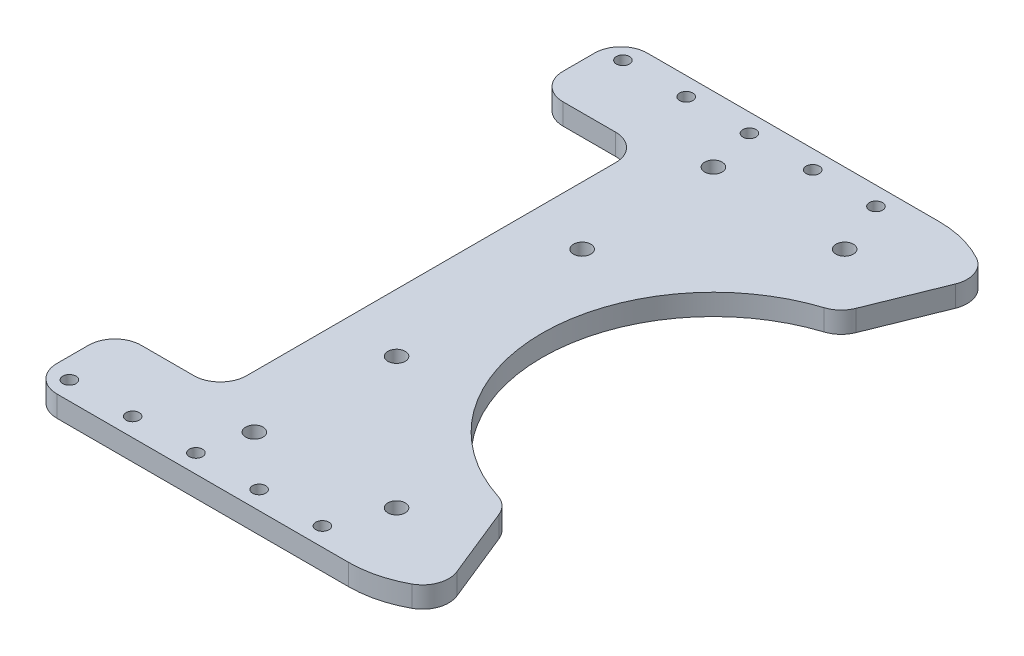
ISO-10303-21;
HEADER;
FILE_DESCRIPTION(('STEP AP214'),'2;1');
FILE_NAME('part.step','',(''),(''),'','','');
FILE_SCHEMA(('AUTOMOTIVE_DESIGN { 1 0 10303 214 1 1 1 1 }'));
ENDSEC;
DATA;
#1=APPLICATION_CONTEXT('core data for automotive mechanical design processes');
#2=APPLICATION_PROTOCOL_DEFINITION('international standard','automotive_design',2000,#1);
#3=PRODUCT_CONTEXT('',#1,'mechanical');
#4=PRODUCT('Part','Part','',(#3));
#5=PRODUCT_RELATED_PRODUCT_CATEGORY('part','',(#4));
#6=PRODUCT_DEFINITION_FORMATION('','',#4);
#7=PRODUCT_DEFINITION_CONTEXT('part definition',#1,'design');
#8=PRODUCT_DEFINITION('design','',#6,#7);
#9=PRODUCT_DEFINITION_SHAPE('','',#8);
#10=(LENGTH_UNIT() NAMED_UNIT(*) SI_UNIT(.MILLI.,.METRE.));
#11=(NAMED_UNIT(*) PLANE_ANGLE_UNIT() SI_UNIT($,.RADIAN.));
#12=(NAMED_UNIT(*) SI_UNIT($,.STERADIAN.) SOLID_ANGLE_UNIT());
#13=UNCERTAINTY_MEASURE_WITH_UNIT(LENGTH_MEASURE(1.E-05),#10,'distance_accuracy_value','');
#14=(GEOMETRIC_REPRESENTATION_CONTEXT(3) GLOBAL_UNCERTAINTY_ASSIGNED_CONTEXT((#13)) GLOBAL_UNIT_ASSIGNED_CONTEXT((#10,
#11,#12)) REPRESENTATION_CONTEXT('',''));
#15=CARTESIAN_POINT('',(0.,0.,0.));
#16=DIRECTION('',(0.,0.,1.));
#17=DIRECTION('',(1.,0.,0.));
#18=AXIS2_PLACEMENT_3D('',#15,#16,#17);
#19=CARTESIAN_POINT('',(83.4007857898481,3.,-81.060672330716));
#20=DIRECTION('',(1.,0.,0.));
#21=DIRECTION('',(0.,0.,-1.));
#22=AXIS2_PLACEMENT_3D('',#19,#20,#21);
#23=PLANE('',#22);
#24=DIRECTION('',(0.,0.,-1.));
#25=VECTOR('',#24,1.);
#26=CARTESIAN_POINT('',(83.4007857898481,3.,-81.060672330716));
#27=LINE('',#26,#25);
#28=CARTESIAN_POINT('',(83.4007857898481,3.,51.));
#29=VERTEX_POINT('',#28);
#30=CARTESIAN_POINT('',(83.4007857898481,3.,45.));
#31=VERTEX_POINT('',#30);
#32=EDGE_CURVE('E235',#29,#31,#27,.T.);
#33=ORIENTED_EDGE('',*,*,#32,.T.);
#34=DIRECTION('',(0.,1.,0.));
#35=VECTOR('',#34,1.);
#36=CARTESIAN_POINT('',(83.4007857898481,3.,45.));
#37=LINE('',#36,#35);
#38=CARTESIAN_POINT('',(83.4007857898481,-1.,45.));
#39=VERTEX_POINT('',#38);
#40=EDGE_CURVE('E486',#31,#39,#37,.F.);
#41=ORIENTED_EDGE('',*,*,#40,.T.);
#42=DIRECTION('',(0.,0.,1.));
#43=VECTOR('',#42,1.);
#44=CARTESIAN_POINT('',(83.4007857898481,-1.,0.));
#45=LINE('',#44,#43);
#46=CARTESIAN_POINT('',(83.4007857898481,-1.,51.));
#47=VERTEX_POINT('',#46);
#48=EDGE_CURVE('E394',#47,#39,#45,.F.);
#49=ORIENTED_EDGE('',*,*,#48,.F.);
#50=DIRECTION('',(0.,1.,0.));
#51=VECTOR('',#50,1.);
#52=CARTESIAN_POINT('',(83.4007857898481,3.,51.));
#53=LINE('',#52,#51);
#54=EDGE_CURVE('E457',#47,#29,#53,.T.);
#55=ORIENTED_EDGE('',*,*,#54,.T.);
#56=EDGE_LOOP('',(#33,#41,#49,#55));
#57=FACE_BOUND('',#56,.T.);
#58=ADVANCED_FACE('F49',(#57),#23,.F.);
#59=CARTESIAN_POINT('',(0.,3.,0.));
#60=DIRECTION('',(0.,1.,0.));
#61=DIRECTION('',(0.,0.,1.));
#62=AXIS2_PLACEMENT_3D('',#59,#60,#61);
#63=PLANE('',#62);
#64=CARTESIAN_POINT('',(99.2778298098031,3.,52.4999999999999));
#65=DIRECTION('',(0.,-1.,0.));
#66=DIRECTION('',(0.,0.,-1.));
#67=AXIS2_PLACEMENT_3D('',#64,#65,#66);
#68=CIRCLE('',#67,1.25);
#69=CARTESIAN_POINT('',(99.2778298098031,3.,51.2499999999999));
#70=VERTEX_POINT('',#69);
#71=EDGE_CURVE('E424',#70,#70,#68,.T.);
#72=ORIENTED_EDGE('',*,*,#71,.T.);
#73=EDGE_LOOP('',(#72));
#74=FACE_BOUND('',#73,.T.);
#75=CARTESIAN_POINT('',(111.277829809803,3.,52.4999999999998));
#76=DIRECTION('',(0.,-1.,0.));
#77=DIRECTION('',(0.,0.,-1.));
#78=AXIS2_PLACEMENT_3D('',#75,#76,#77);
#79=CIRCLE('',#78,1.25);
#80=CARTESIAN_POINT('',(111.277829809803,3.,51.2499999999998));
#81=VERTEX_POINT('',#80);
#82=EDGE_CURVE('E549',#81,#81,#79,.T.);
#83=ORIENTED_EDGE('',*,*,#82,.T.);
#84=EDGE_LOOP('',(#83));
#85=FACE_BOUND('',#84,.T.);
#86=CARTESIAN_POINT('',(135.277829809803,3.,-52.5));
#87=DIRECTION('',(0.,1.,0.));
#88=DIRECTION('',(0.,0.,1.));
#89=AXIS2_PLACEMENT_3D('',#86,#87,#88);
#90=CIRCLE('',#89,1.25000000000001);
#91=CARTESIAN_POINT('',(135.277829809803,3.,-51.25));
#92=VERTEX_POINT('',#91);
#93=EDGE_CURVE('E553',#92,#92,#90,.T.);
#94=ORIENTED_EDGE('',*,*,#93,.F.);
#95=EDGE_LOOP('',(#94));
#96=FACE_BOUND('',#95,.T.);
#97=CARTESIAN_POINT('',(123.277829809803,3.,-52.4999999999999));
#98=DIRECTION('',(0.,1.,0.));
#99=DIRECTION('',(0.,0.,1.));
#100=AXIS2_PLACEMENT_3D('',#97,#98,#99);
#101=CIRCLE('',#100,1.25);
#102=CARTESIAN_POINT('',(123.277829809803,3.,-51.2499999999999));
#103=VERTEX_POINT('',#102);
#104=EDGE_CURVE('E557',#103,#103,#101,.T.);
#105=ORIENTED_EDGE('',*,*,#104,.F.);
#106=EDGE_LOOP('',(#105));
#107=FACE_BOUND('',#106,.T.);
#108=CARTESIAN_POINT('',(113.400785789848,3.,-43.5370440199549));
#109=DIRECTION('',(0.,1.,0.));
#110=DIRECTION('',(0.,0.,1.));
#111=AXIS2_PLACEMENT_3D('',#108,#109,#110);
#112=CIRCLE('',#111,1.65);
#113=CARTESIAN_POINT('',(113.400785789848,3.,-41.8870440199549));
#114=VERTEX_POINT('',#113);
#115=EDGE_CURVE('E561',#114,#114,#112,.T.);
#116=ORIENTED_EDGE('',*,*,#115,.F.);
#117=EDGE_LOOP('',(#116));
#118=FACE_BOUND('',#117,.T.);
#119=CARTESIAN_POINT('',(114.437947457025,3.,17.6));
#120=DIRECTION('',(0.,1.,0.));
#121=DIRECTION('',(0.,0.,1.));
#122=AXIS2_PLACEMENT_3D('',#119,#120,#121);
#123=CIRCLE('',#122,1.65);
#124=CARTESIAN_POINT('',(114.437947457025,3.,19.25));
#125=VERTEX_POINT('',#124);
#126=EDGE_CURVE('E565',#125,#125,#123,.T.);
#127=ORIENTED_EDGE('',*,*,#126,.F.);
#128=EDGE_LOOP('',(#127));
#129=FACE_BOUND('',#128,.T.);
#130=CARTESIAN_POINT('',(114.44079544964,3.,-17.6068756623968));
#131=DIRECTION('',(0.,1.,0.));
#132=DIRECTION('',(0.,0.,1.));
#133=AXIS2_PLACEMENT_3D('',#130,#131,#132);
#134=CIRCLE('',#133,1.65);
#135=CARTESIAN_POINT('',(114.44079544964,3.,-15.9568756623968));
#136=VERTEX_POINT('',#135);
#137=EDGE_CURVE('E569',#136,#136,#134,.T.);
#138=ORIENTED_EDGE('',*,*,#137,.F.);
#139=EDGE_LOOP('',(#138));
#140=FACE_BOUND('',#139,.T.);
#141=CARTESIAN_POINT('',(139.337829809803,3.,-42.4998823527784));
#142=DIRECTION('',(0.,1.,0.));
#143=DIRECTION('',(0.,0.,1.));
#144=AXIS2_PLACEMENT_3D('',#141,#142,#143);
#145=CIRCLE('',#144,1.65000000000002);
#146=CARTESIAN_POINT('',(139.337829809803,3.,-40.8498823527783));
#147=VERTEX_POINT('',#146);
#148=EDGE_CURVE('E573',#147,#147,#145,.T.);
#149=ORIENTED_EDGE('',*,*,#148,.F.);
#150=EDGE_LOOP('',(#149));
#151=FACE_BOUND('',#150,.T.);
#152=CARTESIAN_POINT('',(139.330954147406,3.,42.4970343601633));
#153=DIRECTION('',(0.,1.,0.));
#154=DIRECTION('',(0.,0.,1.));
#155=AXIS2_PLACEMENT_3D('',#152,#153,#154);
#156=CIRCLE('',#155,1.65000000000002);
#157=CARTESIAN_POINT('',(139.330954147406,3.,44.1470343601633));
#158=VERTEX_POINT('',#157);
#159=EDGE_CURVE('E577',#158,#158,#156,.T.);
#160=ORIENTED_EDGE('',*,*,#159,.F.);
#161=EDGE_LOOP('',(#160));
#162=FACE_BOUND('',#161,.T.);
#163=CARTESIAN_POINT('',(113.400785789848,3.,43.5370440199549));
#164=DIRECTION('',(0.,1.,0.));
#165=DIRECTION('',(0.,0.,1.));
#166=AXIS2_PLACEMENT_3D('',#163,#164,#165);
#167=CIRCLE('',#166,1.65);
#168=CARTESIAN_POINT('',(113.400785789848,3.,45.1870440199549));
#169=VERTEX_POINT('',#168);
#170=EDGE_CURVE('E225',#169,#169,#167,.F.);
#171=ORIENTED_EDGE('',*,*,#170,.T.);
#172=EDGE_LOOP('',(#171));
#173=FACE_BOUND('',#172,.T.);
#174=CARTESIAN_POINT('',(111.277829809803,3.,-52.4999999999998));
#175=DIRECTION('',(0.,1.,0.));
#176=DIRECTION('',(0.,0.,1.));
#177=AXIS2_PLACEMENT_3D('',#174,#175,#176);
#178=CIRCLE('',#177,1.25);
#179=CARTESIAN_POINT('',(111.277829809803,3.,-51.2499999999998));
#180=VERTEX_POINT('',#179);
#181=EDGE_CURVE('E282',#180,#180,#178,.T.);
#182=ORIENTED_EDGE('',*,*,#181,.F.);
#183=EDGE_LOOP('',(#182));
#184=FACE_BOUND('',#183,.T.);
#185=CARTESIAN_POINT('',(87.2778298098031,3.,52.5));
#186=DIRECTION('',(0.,-1.,0.));
#187=DIRECTION('',(0.,0.,-1.));
#188=AXIS2_PLACEMENT_3D('',#185,#186,#187);
#189=CIRCLE('',#188,1.25);
#190=CARTESIAN_POINT('',(87.2778298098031,3.,51.25));
#191=VERTEX_POINT('',#190);
#192=EDGE_CURVE('E286',#191,#191,#189,.T.);
#193=ORIENTED_EDGE('',*,*,#192,.T.);
#194=EDGE_LOOP('',(#193));
#195=FACE_BOUND('',#194,.T.);
#196=CARTESIAN_POINT('',(123.277829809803,3.,52.4999999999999));
#197=DIRECTION('',(0.,-1.,0.));
#198=DIRECTION('',(0.,0.,-1.));
#199=AXIS2_PLACEMENT_3D('',#196,#197,#198);
#200=CIRCLE('',#199,1.25);
#201=CARTESIAN_POINT('',(123.277829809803,3.,51.2499999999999));
#202=VERTEX_POINT('',#201);
#203=EDGE_CURVE('E290',#202,#202,#200,.T.);
#204=ORIENTED_EDGE('',*,*,#203,.T.);
#205=EDGE_LOOP('',(#204));
#206=FACE_BOUND('',#205,.T.);
#207=CARTESIAN_POINT('',(87.2778298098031,3.,-52.4999999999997));
#208=DIRECTION('',(0.,1.,0.));
#209=DIRECTION('',(0.,0.,1.));
#210=AXIS2_PLACEMENT_3D('',#207,#208,#209);
#211=CIRCLE('',#210,1.25);
#212=CARTESIAN_POINT('',(87.2778298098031,3.,-51.2499999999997));
#213=VERTEX_POINT('',#212);
#214=EDGE_CURVE('E294',#213,#213,#211,.T.);
#215=ORIENTED_EDGE('',*,*,#214,.F.);
#216=EDGE_LOOP('',(#215));
#217=FACE_BOUND('',#216,.T.);
#218=CARTESIAN_POINT('',(99.2778298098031,3.,-52.4999999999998));
#219=DIRECTION('',(0.,1.,0.));
#220=DIRECTION('',(0.,0.,1.));
#221=AXIS2_PLACEMENT_3D('',#218,#219,#220);
#222=CIRCLE('',#221,1.25);
#223=CARTESIAN_POINT('',(99.2778298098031,3.,-51.2499999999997));
#224=VERTEX_POINT('',#223);
#225=EDGE_CURVE('E298',#224,#224,#222,.T.);
#226=ORIENTED_EDGE('',*,*,#225,.F.);
#227=EDGE_LOOP('',(#226));
#228=FACE_BOUND('',#227,.T.);
#229=CARTESIAN_POINT('',(135.277829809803,3.,52.5));
#230=DIRECTION('',(0.,-1.,0.));
#231=DIRECTION('',(0.,0.,-1.));
#232=AXIS2_PLACEMENT_3D('',#229,#230,#231);
#233=CIRCLE('',#232,1.25000000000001);
#234=CARTESIAN_POINT('',(135.277829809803,3.,51.25));
#235=VERTEX_POINT('',#234);
#236=EDGE_CURVE('E213',#235,#235,#233,.T.);
#237=ORIENTED_EDGE('',*,*,#236,.T.);
#238=EDGE_LOOP('',(#237));
#239=FACE_BOUND('',#238,.T.);
#240=DIRECTION('',(-1.,0.,0.));
#241=VECTOR('',#240,1.);
#242=CARTESIAN_POINT('',(0.,3.,40.));
#243=LINE('',#242,#241);
#244=CARTESIAN_POINT('',(98.4007857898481,3.,40.));
#245=VERTEX_POINT('',#244);
#246=CARTESIAN_POINT('',(88.4007857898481,3.,40.));
#247=VERTEX_POINT('',#246);
#248=EDGE_CURVE('E310',#245,#247,#243,.T.);
#249=ORIENTED_EDGE('',*,*,#248,.T.);
#250=CARTESIAN_POINT('',(88.4007857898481,3.,45.));
#251=DIRECTION('',(0.,1.,0.));
#252=DIRECTION('',(0.,0.,1.));
#253=AXIS2_PLACEMENT_3D('',#250,#251,#252);
#254=CIRCLE('',#253,5.);
#255=EDGE_CURVE('E483',#247,#31,#254,.T.);
#256=ORIENTED_EDGE('',*,*,#255,.T.);
#257=ORIENTED_EDGE('',*,*,#32,.F.);
#258=CARTESIAN_POINT('',(88.4007857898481,3.,51.));
#259=DIRECTION('',(0.,1.,0.));
#260=DIRECTION('',(0.,0.,1.));
#261=AXIS2_PLACEMENT_3D('',#258,#259,#260);
#262=CIRCLE('',#261,5.);
#263=CARTESIAN_POINT('',(88.4007857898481,3.,56.));
#264=VERTEX_POINT('',#263);
#265=EDGE_CURVE('E241',#29,#264,#262,.T.);
#266=ORIENTED_EDGE('',*,*,#265,.T.);
#267=DIRECTION('',(1.,0.,0.));
#268=VECTOR('',#267,1.);
#269=CARTESIAN_POINT('',(-100.,3.,56.));
#270=LINE('',#269,#268);
#271=CARTESIAN_POINT('',(143.705644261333,3.,56.));
#272=VERTEX_POINT('',#271);
#273=EDGE_CURVE('E245',#264,#272,#270,.T.);
#274=ORIENTED_EDGE('',*,*,#273,.T.);
#275=CARTESIAN_POINT('',(143.705644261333,3.,36.));
#276=DIRECTION('',(0.,1.,0.));
#277=DIRECTION('',(0.,0.,1.));
#278=AXIS2_PLACEMENT_3D('',#275,#276,#277);
#279=CIRCLE('',#278,20.);
#280=CARTESIAN_POINT('',(153.315348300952,3.,53.5400566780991));
#281=VERTEX_POINT('',#280);
#282=EDGE_CURVE('E249',#272,#281,#279,.T.);
#283=ORIENTED_EDGE('',*,*,#282,.T.);
#284=CARTESIAN_POINT('',(150.912922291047,3.,49.1550425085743));
#285=DIRECTION('',(0.,1.,0.));
#286=DIRECTION('',(0.,0.,1.));
#287=AXIS2_PLACEMENT_3D('',#284,#285,#286);
#288=CIRCLE('',#287,5.);
#289=CARTESIAN_POINT('',(155.548841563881,3.,47.2820095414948));
#290=VERTEX_POINT('',#289);
#291=EDGE_CURVE('E253',#281,#290,#288,.T.);
#292=ORIENTED_EDGE('',*,*,#291,.T.);
#293=DIRECTION('',(0.374606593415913,0.,0.927183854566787));
#294=VECTOR('',#293,1.);
#295=CARTESIAN_POINT('',(117.298235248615,3.,-47.3915632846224));
#296=LINE('',#295,#294);
#297=CARTESIAN_POINT('',(150.11527308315,3.,33.8334556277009));
#298=VERTEX_POINT('',#297);
#299=EDGE_CURVE('E257',#298,#290,#296,.T.);
#300=ORIENTED_EDGE('',*,*,#299,.F.);
#301=CARTESIAN_POINT('',(145.479353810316,3.,35.7064885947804));
#302=DIRECTION('',(0.,1.,0.));
#303=DIRECTION('',(0.,0.,1.));
#304=AXIS2_PLACEMENT_3D('',#301,#302,#303);
#305=CIRCLE('',#304,5.);
#306=CARTESIAN_POINT('',(147.007150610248,3.,30.9456234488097));
#307=VERTEX_POINT('',#306);
#308=EDGE_CURVE('E261',#298,#307,#305,.T.);
#309=ORIENTED_EDGE('',*,*,#308,.T.);
#310=CARTESIAN_POINT('',(156.937829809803,3.,0.));
#311=DIRECTION('',(0.,1.,0.));
#312=DIRECTION('',(0.,0.,1.));
#313=AXIS2_PLACEMENT_3D('',#310,#311,#312);
#314=CIRCLE('',#313,32.5);
#315=CARTESIAN_POINT('',(147.007150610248,3.,-30.9456234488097));
#316=VERTEX_POINT('',#315);
#317=EDGE_CURVE('E265',#316,#307,#314,.T.);
#318=ORIENTED_EDGE('',*,*,#317,.F.);
#319=CARTESIAN_POINT('',(145.479353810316,3.,-35.7064885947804));
#320=DIRECTION('',(0.,1.,0.));
#321=DIRECTION('',(0.,0.,1.));
#322=AXIS2_PLACEMENT_3D('',#319,#320,#321);
#323=CIRCLE('',#322,5.);
#324=CARTESIAN_POINT('',(150.11527308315,3.,-33.8334556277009));
#325=VERTEX_POINT('',#324);
#326=EDGE_CURVE('E269',#316,#325,#323,.T.);
#327=ORIENTED_EDGE('',*,*,#326,.T.);
#328=DIRECTION('',(0.374606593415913,0.,-0.927183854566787));
#329=VECTOR('',#328,1.);
#330=CARTESIAN_POINT('',(117.298235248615,3.,47.3915632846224));
#331=LINE('',#330,#329);
#332=CARTESIAN_POINT('',(155.548841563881,3.,-47.2820095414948));
#333=VERTEX_POINT('',#332);
#334=EDGE_CURVE('E273',#325,#333,#331,.T.);
#335=ORIENTED_EDGE('',*,*,#334,.T.);
#336=CARTESIAN_POINT('',(150.912922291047,3.,-49.1550425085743));
#337=DIRECTION('',(0.,1.,0.));
#338=DIRECTION('',(0.,0.,1.));
#339=AXIS2_PLACEMENT_3D('',#336,#337,#338);
#340=CIRCLE('',#339,5.);
#341=CARTESIAN_POINT('',(153.315348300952,3.,-53.5400566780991));
#342=VERTEX_POINT('',#341);
#343=EDGE_CURVE('E277',#333,#342,#340,.T.);
#344=ORIENTED_EDGE('',*,*,#343,.T.);
#345=CARTESIAN_POINT('',(143.705644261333,3.,-36.));
#346=DIRECTION('',(0.,1.,0.));
#347=DIRECTION('',(0.,0.,1.));
#348=AXIS2_PLACEMENT_3D('',#345,#346,#347);
#349=CIRCLE('',#348,20.);
#350=CARTESIAN_POINT('',(143.705644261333,3.,-56.));
#351=VERTEX_POINT('',#350);
#352=EDGE_CURVE('E223',#342,#351,#349,.T.);
#353=ORIENTED_EDGE('',*,*,#352,.T.);
#354=DIRECTION('',(-1.,0.,0.));
#355=VECTOR('',#354,1.);
#356=CARTESIAN_POINT('',(-100.,3.,-56.));
#357=LINE('',#356,#355);
#358=CARTESIAN_POINT('',(88.4007857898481,3.,-56.));
#359=VERTEX_POINT('',#358);
#360=EDGE_CURVE('E203',#351,#359,#357,.T.);
#361=ORIENTED_EDGE('',*,*,#360,.T.);
#362=CARTESIAN_POINT('',(88.4007857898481,3.,-51.));
#363=DIRECTION('',(0.,1.,0.));
#364=DIRECTION('',(0.,0.,1.));
#365=AXIS2_PLACEMENT_3D('',#362,#363,#364);
#366=CIRCLE('',#365,5.);
#367=CARTESIAN_POINT('',(83.4007857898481,3.,-51.));
#368=VERTEX_POINT('',#367);
#369=EDGE_CURVE('E220',#359,#368,#366,.T.);
#370=ORIENTED_EDGE('',*,*,#369,.T.);
#371=CARTESIAN_POINT('',(83.4007857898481,3.,-45.));
#372=VERTEX_POINT('',#371);
#373=EDGE_CURVE('E232',#372,#368,#27,.T.);
#374=ORIENTED_EDGE('',*,*,#373,.F.);
#375=CARTESIAN_POINT('',(88.4007857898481,3.,-45.));
#376=DIRECTION('',(0.,1.,0.));
#377=DIRECTION('',(0.,0.,1.));
#378=AXIS2_PLACEMENT_3D('',#375,#376,#377);
#379=CIRCLE('',#378,5.);
#380=CARTESIAN_POINT('',(88.4007857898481,3.,-40.));
#381=VERTEX_POINT('',#380);
#382=EDGE_CURVE('E480',#372,#381,#379,.T.);
#383=ORIENTED_EDGE('',*,*,#382,.T.);
#384=DIRECTION('',(-1.,0.,0.));
#385=VECTOR('',#384,1.);
#386=CARTESIAN_POINT('',(0.,3.,-40.));
#387=LINE('',#386,#385);
#388=CARTESIAN_POINT('',(98.4007857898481,3.,-40.));
#389=VERTEX_POINT('',#388);
#390=EDGE_CURVE('E521',#389,#381,#387,.T.);
#391=ORIENTED_EDGE('',*,*,#390,.F.);
#392=CARTESIAN_POINT('',(98.4007857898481,3.,-35.));
#393=DIRECTION('',(0.,1.,0.));
#394=DIRECTION('',(0.,0.,1.));
#395=AXIS2_PLACEMENT_3D('',#392,#393,#394);
#396=CIRCLE('',#395,5.);
#397=CARTESIAN_POINT('',(103.400785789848,3.,-35.));
#398=VERTEX_POINT('',#397);
#399=EDGE_CURVE('E58',#389,#398,#396,.F.);
#400=ORIENTED_EDGE('',*,*,#399,.T.);
#401=DIRECTION('',(0.,0.,-1.));
#402=VECTOR('',#401,1.);
#403=CARTESIAN_POINT('',(103.400785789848,3.,0.));
#404=LINE('',#403,#402);
#405=CARTESIAN_POINT('',(103.400785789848,3.,35.));
#406=VERTEX_POINT('',#405);
#407=EDGE_CURVE('E520',#406,#398,#404,.T.);
#408=ORIENTED_EDGE('',*,*,#407,.F.);
#409=CARTESIAN_POINT('',(98.4007857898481,3.,35.));
#410=DIRECTION('',(0.,1.,0.));
#411=DIRECTION('',(0.,0.,1.));
#412=AXIS2_PLACEMENT_3D('',#409,#410,#411);
#413=CIRCLE('',#412,5.);
#414=EDGE_CURVE('E511',#406,#245,#413,.F.);
#415=ORIENTED_EDGE('',*,*,#414,.T.);
#416=EDGE_LOOP('',(#249,#256,#257,#266,#274,#283,#292,#300,#309,#318,#327,#335,#344,#353,#361,
#370,#374,#383,#391,#400,#408,#415));
#417=FACE_BOUND('',#416,.T.);
#418=ADVANCED_FACE('F218',(#74,#85,#96,#107,#118,#129,#140,#151,#162,#173,#184,#195,#206,#217,
#228,#239,#417),#63,.T.);
#419=CARTESIAN_POINT('',(0.,-1.,0.));
#420=DIRECTION('',(0.,1.,0.));
#421=DIRECTION('',(0.,0.,1.));
#422=AXIS2_PLACEMENT_3D('',#419,#420,#421);
#423=PLANE('',#422);
#424=CARTESIAN_POINT('',(135.277829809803,-1.,52.5));
#425=DIRECTION('',(0.,-1.,0.));
#426=DIRECTION('',(0.,0.,-1.));
#427=AXIS2_PLACEMENT_3D('',#424,#425,#426);
#428=CIRCLE('',#427,1.25000000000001);
#429=CARTESIAN_POINT('',(135.277829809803,-1.,51.25));
#430=VERTEX_POINT('',#429);
#431=EDGE_CURVE('E420',#430,#430,#428,.T.);
#432=ORIENTED_EDGE('',*,*,#431,.F.);
#433=EDGE_LOOP('',(#432));
#434=FACE_BOUND('',#433,.T.);
#435=CARTESIAN_POINT('',(99.2778298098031,-1.,-52.4999999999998));
#436=DIRECTION('',(0.,1.,0.));
#437=DIRECTION('',(0.,0.,1.));
#438=AXIS2_PLACEMENT_3D('',#435,#436,#437);
#439=CIRCLE('',#438,1.25);
#440=CARTESIAN_POINT('',(99.2778298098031,-1.,-51.2499999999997));
#441=VERTEX_POINT('',#440);
#442=EDGE_CURVE('E416',#441,#441,#439,.T.);
#443=ORIENTED_EDGE('',*,*,#442,.T.);
#444=EDGE_LOOP('',(#443));
#445=FACE_BOUND('',#444,.T.);
#446=CARTESIAN_POINT('',(87.2778298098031,-1.,-52.4999999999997));
#447=DIRECTION('',(0.,1.,0.));
#448=DIRECTION('',(0.,0.,1.));
#449=AXIS2_PLACEMENT_3D('',#446,#447,#448);
#450=CIRCLE('',#449,1.25);
#451=CARTESIAN_POINT('',(87.2778298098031,-1.,-51.2499999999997));
#452=VERTEX_POINT('',#451);
#453=EDGE_CURVE('E412',#452,#452,#450,.T.);
#454=ORIENTED_EDGE('',*,*,#453,.T.);
#455=EDGE_LOOP('',(#454));
#456=FACE_BOUND('',#455,.T.);
#457=CARTESIAN_POINT('',(123.277829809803,-1.,52.4999999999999));
#458=DIRECTION('',(0.,-1.,0.));
#459=DIRECTION('',(0.,0.,-1.));
#460=AXIS2_PLACEMENT_3D('',#457,#458,#459);
#461=CIRCLE('',#460,1.25);
#462=CARTESIAN_POINT('',(123.277829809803,-1.,51.2499999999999));
#463=VERTEX_POINT('',#462);
#464=EDGE_CURVE('E408',#463,#463,#461,.T.);
#465=ORIENTED_EDGE('',*,*,#464,.F.);
#466=EDGE_LOOP('',(#465));
#467=FACE_BOUND('',#466,.T.);
#468=CARTESIAN_POINT('',(87.2778298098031,-1.,52.5));
#469=DIRECTION('',(0.,-1.,0.));
#470=DIRECTION('',(0.,0.,-1.));
#471=AXIS2_PLACEMENT_3D('',#468,#469,#470);
#472=CIRCLE('',#471,1.25);
#473=CARTESIAN_POINT('',(87.2778298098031,-1.,51.25));
#474=VERTEX_POINT('',#473);
#475=EDGE_CURVE('E404',#474,#474,#472,.T.);
#476=ORIENTED_EDGE('',*,*,#475,.F.);
#477=EDGE_LOOP('',(#476));
#478=FACE_BOUND('',#477,.T.);
#479=CARTESIAN_POINT('',(111.277829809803,-1.,-52.4999999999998));
#480=DIRECTION('',(0.,1.,0.));
#481=DIRECTION('',(0.,0.,1.));
#482=AXIS2_PLACEMENT_3D('',#479,#480,#481);
#483=CIRCLE('',#482,1.25);
#484=CARTESIAN_POINT('',(111.277829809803,-1.,-51.2499999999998));
#485=VERTEX_POINT('',#484);
#486=EDGE_CURVE('E353',#485,#485,#483,.T.);
#487=ORIENTED_EDGE('',*,*,#486,.T.);
#488=EDGE_LOOP('',(#487));
#489=FACE_BOUND('',#488,.T.);
#490=CARTESIAN_POINT('',(113.400785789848,-1.,43.5370440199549));
#491=DIRECTION('',(0.,1.,0.));
#492=DIRECTION('',(0.,0.,1.));
#493=AXIS2_PLACEMENT_3D('',#490,#491,#492);
#494=CIRCLE('',#493,1.65);
#495=CARTESIAN_POINT('',(113.400785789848,-1.,45.1870440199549));
#496=VERTEX_POINT('',#495);
#497=EDGE_CURVE('E342',#496,#496,#494,.F.);
#498=ORIENTED_EDGE('',*,*,#497,.F.);
#499=EDGE_LOOP('',(#498));
#500=FACE_BOUND('',#499,.T.);
#501=CARTESIAN_POINT('',(139.330954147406,-1.,42.4970343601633));
#502=DIRECTION('',(0.,1.,0.));
#503=DIRECTION('',(0.,0.,1.));
#504=AXIS2_PLACEMENT_3D('',#501,#502,#503);
#505=CIRCLE('',#504,1.65000000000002);
#506=CARTESIAN_POINT('',(139.330954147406,-1.,44.1470343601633));
#507=VERTEX_POINT('',#506);
#508=EDGE_CURVE('E338',#507,#507,#505,.T.);
#509=ORIENTED_EDGE('',*,*,#508,.T.);
#510=EDGE_LOOP('',(#509));
#511=FACE_BOUND('',#510,.T.);
#512=CARTESIAN_POINT('',(139.337829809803,-1.,-42.4998823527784));
#513=DIRECTION('',(0.,1.,0.));
#514=DIRECTION('',(0.,0.,1.));
#515=AXIS2_PLACEMENT_3D('',#512,#513,#514);
#516=CIRCLE('',#515,1.65000000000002);
#517=CARTESIAN_POINT('',(139.337829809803,-1.,-40.8498823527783));
#518=VERTEX_POINT('',#517);
#519=EDGE_CURVE('E334',#518,#518,#516,.T.);
#520=ORIENTED_EDGE('',*,*,#519,.T.);
#521=EDGE_LOOP('',(#520));
#522=FACE_BOUND('',#521,.T.);
#523=CARTESIAN_POINT('',(114.44079544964,-1.,-17.6068756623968));
#524=DIRECTION('',(0.,1.,0.));
#525=DIRECTION('',(0.,0.,1.));
#526=AXIS2_PLACEMENT_3D('',#523,#524,#525);
#527=CIRCLE('',#526,1.65);
#528=CARTESIAN_POINT('',(114.44079544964,-1.,-15.9568756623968));
#529=VERTEX_POINT('',#528);
#530=EDGE_CURVE('E330',#529,#529,#527,.T.);
#531=ORIENTED_EDGE('',*,*,#530,.T.);
#532=EDGE_LOOP('',(#531));
#533=FACE_BOUND('',#532,.T.);
#534=CARTESIAN_POINT('',(114.437947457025,-1.,17.6));
#535=DIRECTION('',(0.,1.,0.));
#536=DIRECTION('',(0.,0.,1.));
#537=AXIS2_PLACEMENT_3D('',#534,#535,#536);
#538=CIRCLE('',#537,1.65);
#539=CARTESIAN_POINT('',(114.437947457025,-1.,19.25));
#540=VERTEX_POINT('',#539);
#541=EDGE_CURVE('E326',#540,#540,#538,.T.);
#542=ORIENTED_EDGE('',*,*,#541,.T.);
#543=EDGE_LOOP('',(#542));
#544=FACE_BOUND('',#543,.T.);
#545=CARTESIAN_POINT('',(113.400785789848,-1.,-43.5370440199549));
#546=DIRECTION('',(0.,1.,0.));
#547=DIRECTION('',(0.,0.,1.));
#548=AXIS2_PLACEMENT_3D('',#545,#546,#547);
#549=CIRCLE('',#548,1.65);
#550=CARTESIAN_POINT('',(113.400785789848,-1.,-41.8870440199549));
#551=VERTEX_POINT('',#550);
#552=EDGE_CURVE('E322',#551,#551,#549,.T.);
#553=ORIENTED_EDGE('',*,*,#552,.T.);
#554=EDGE_LOOP('',(#553));
#555=FACE_BOUND('',#554,.T.);
#556=CARTESIAN_POINT('',(123.277829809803,-1.,-52.4999999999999));
#557=DIRECTION('',(0.,1.,0.));
#558=DIRECTION('',(0.,0.,1.));
#559=AXIS2_PLACEMENT_3D('',#556,#557,#558);
#560=CIRCLE('',#559,1.25);
#561=CARTESIAN_POINT('',(123.277829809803,-1.,-51.2499999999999));
#562=VERTEX_POINT('',#561);
#563=EDGE_CURVE('E318',#562,#562,#560,.T.);
#564=ORIENTED_EDGE('',*,*,#563,.T.);
#565=EDGE_LOOP('',(#564));
#566=FACE_BOUND('',#565,.T.);
#567=CARTESIAN_POINT('',(135.277829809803,-1.,-52.5));
#568=DIRECTION('',(0.,1.,0.));
#569=DIRECTION('',(0.,0.,1.));
#570=AXIS2_PLACEMENT_3D('',#567,#568,#569);
#571=CIRCLE('',#570,1.25000000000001);
#572=CARTESIAN_POINT('',(135.277829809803,-1.,-51.25));
#573=VERTEX_POINT('',#572);
#574=EDGE_CURVE('E314',#573,#573,#571,.T.);
#575=ORIENTED_EDGE('',*,*,#574,.T.);
#576=EDGE_LOOP('',(#575));
#577=FACE_BOUND('',#576,.T.);
#578=CARTESIAN_POINT('',(111.277829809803,-1.,52.4999999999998));
#579=DIRECTION('',(0.,-1.,0.));
#580=DIRECTION('',(0.,0.,-1.));
#581=AXIS2_PLACEMENT_3D('',#578,#579,#580);
#582=CIRCLE('',#581,1.25);
#583=CARTESIAN_POINT('',(111.277829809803,-1.,51.2499999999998));
#584=VERTEX_POINT('',#583);
#585=EDGE_CURVE('E309',#584,#584,#582,.T.);
#586=ORIENTED_EDGE('',*,*,#585,.F.);
#587=EDGE_LOOP('',(#586));
#588=FACE_BOUND('',#587,.T.);
#589=CARTESIAN_POINT('',(99.2778298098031,-1.,52.4999999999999));
#590=DIRECTION('',(0.,-1.,0.));
#591=DIRECTION('',(0.,0.,-1.));
#592=AXIS2_PLACEMENT_3D('',#589,#590,#591);
#593=CIRCLE('',#592,1.25);
#594=CARTESIAN_POINT('',(99.2778298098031,-1.,51.2499999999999));
#595=VERTEX_POINT('',#594);
#596=EDGE_CURVE('E305',#595,#595,#593,.T.);
#597=ORIENTED_EDGE('',*,*,#596,.F.);
#598=EDGE_LOOP('',(#597));
#599=FACE_BOUND('',#598,.T.);
#600=ORIENTED_EDGE('',*,*,#48,.T.);
#601=CARTESIAN_POINT('',(88.4007857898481,-1.,45.));
#602=DIRECTION('',(0.,1.,0.));
#603=DIRECTION('',(0.,0.,1.));
#604=AXIS2_PLACEMENT_3D('',#601,#602,#603);
#605=CIRCLE('',#604,5.);
#606=CARTESIAN_POINT('',(88.4007857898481,-1.,40.));
#607=VERTEX_POINT('',#606);
#608=EDGE_CURVE('E491',#39,#607,#605,.F.);
#609=ORIENTED_EDGE('',*,*,#608,.T.);
#610=DIRECTION('',(-1.,0.,0.));
#611=VECTOR('',#610,1.);
#612=CARTESIAN_POINT('',(0.,-1.,40.));
#613=LINE('',#612,#611);
#614=CARTESIAN_POINT('',(98.4007857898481,-1.,40.));
#615=VERTEX_POINT('',#614);
#616=EDGE_CURVE('E469',#615,#607,#613,.T.);
#617=ORIENTED_EDGE('',*,*,#616,.F.);
#618=CARTESIAN_POINT('',(98.4007857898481,-1.,35.));
#619=DIRECTION('',(0.,1.,0.));
#620=DIRECTION('',(0.,0.,1.));
#621=AXIS2_PLACEMENT_3D('',#618,#619,#620);
#622=CIRCLE('',#621,5.);
#623=CARTESIAN_POINT('',(103.400785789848,-1.,35.));
#624=VERTEX_POINT('',#623);
#625=EDGE_CURVE('E514',#615,#624,#622,.T.);
#626=ORIENTED_EDGE('',*,*,#625,.T.);
#627=DIRECTION('',(0.,0.,-1.));
#628=VECTOR('',#627,1.);
#629=CARTESIAN_POINT('',(103.400785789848,-1.,0.));
#630=LINE('',#629,#628);
#631=CARTESIAN_POINT('',(103.400785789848,-1.,-35.));
#632=VERTEX_POINT('',#631);
#633=EDGE_CURVE('E465',#624,#632,#630,.T.);
#634=ORIENTED_EDGE('',*,*,#633,.T.);
#635=CARTESIAN_POINT('',(98.4007857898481,-1.,-35.));
#636=DIRECTION('',(0.,1.,0.));
#637=DIRECTION('',(0.,0.,1.));
#638=AXIS2_PLACEMENT_3D('',#635,#636,#637);
#639=CIRCLE('',#638,5.);
#640=CARTESIAN_POINT('',(98.4007857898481,-1.,-40.));
#641=VERTEX_POINT('',#640);
#642=EDGE_CURVE('E11',#632,#641,#639,.T.);
#643=ORIENTED_EDGE('',*,*,#642,.T.);
#644=DIRECTION('',(-1.,0.,0.));
#645=VECTOR('',#644,1.);
#646=CARTESIAN_POINT('',(0.,-1.,-40.));
#647=LINE('',#646,#645);
#648=CARTESIAN_POINT('',(88.4007857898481,-1.,-40.));
#649=VERTEX_POINT('',#648);
#650=EDGE_CURVE('E461',#641,#649,#647,.T.);
#651=ORIENTED_EDGE('',*,*,#650,.T.);
#652=CARTESIAN_POINT('',(88.4007857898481,-1.,-45.));
#653=DIRECTION('',(0.,1.,0.));
#654=DIRECTION('',(0.,0.,1.));
#655=AXIS2_PLACEMENT_3D('',#652,#653,#654);
#656=CIRCLE('',#655,5.);
#657=CARTESIAN_POINT('',(83.4007857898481,-1.,-45.));
#658=VERTEX_POINT('',#657);
#659=EDGE_CURVE('E65',#649,#658,#656,.F.);
#660=ORIENTED_EDGE('',*,*,#659,.T.);
#661=CARTESIAN_POINT('',(83.4007857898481,-1.,-51.));
#662=VERTEX_POINT('',#661);
#663=EDGE_CURVE('E398',#658,#662,#45,.F.);
#664=ORIENTED_EDGE('',*,*,#663,.T.);
#665=CARTESIAN_POINT('',(88.4007857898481,-1.,-51.));
#666=DIRECTION('',(0.,1.,0.));
#667=DIRECTION('',(0.,0.,1.));
#668=AXIS2_PLACEMENT_3D('',#665,#666,#667);
#669=CIRCLE('',#668,5.);
#670=CARTESIAN_POINT('',(88.4007857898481,-1.,-56.));
#671=VERTEX_POINT('',#670);
#672=EDGE_CURVE('E348',#671,#662,#669,.T.);
#673=ORIENTED_EDGE('',*,*,#672,.F.);
#674=DIRECTION('',(1.,0.,0.));
#675=VECTOR('',#674,1.);
#676=CARTESIAN_POINT('',(0.,-1.,-56.));
#677=LINE('',#676,#675);
#678=CARTESIAN_POINT('',(143.705644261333,-1.,-56.));
#679=VERTEX_POINT('',#678);
#680=EDGE_CURVE('E206',#679,#671,#677,.F.);
#681=ORIENTED_EDGE('',*,*,#680,.F.);
#682=CARTESIAN_POINT('',(143.705644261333,-1.,-36.));
#683=DIRECTION('',(0.,1.,0.));
#684=DIRECTION('',(0.,0.,1.));
#685=AXIS2_PLACEMENT_3D('',#682,#683,#684);
#686=CIRCLE('',#685,20.);
#687=CARTESIAN_POINT('',(153.315348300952,-1.,-53.5400566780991));
#688=VERTEX_POINT('',#687);
#689=EDGE_CURVE('E349',#688,#679,#686,.T.);
#690=ORIENTED_EDGE('',*,*,#689,.F.);
#691=CARTESIAN_POINT('',(150.912922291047,-1.,-49.1550425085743));
#692=DIRECTION('',(0.,1.,0.));
#693=DIRECTION('',(0.,0.,1.));
#694=AXIS2_PLACEMENT_3D('',#691,#692,#693);
#695=CIRCLE('',#694,5.);
#696=CARTESIAN_POINT('',(155.548841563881,-1.,-47.2820095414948));
#697=VERTEX_POINT('',#696);
#698=EDGE_CURVE('E354',#697,#688,#695,.T.);
#699=ORIENTED_EDGE('',*,*,#698,.F.);
#700=DIRECTION('',(0.374606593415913,0.,-0.927183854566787));
#701=VECTOR('',#700,1.);
#702=CARTESIAN_POINT('',(117.298235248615,-1.,47.3915632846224));
#703=LINE('',#702,#701);
#704=CARTESIAN_POINT('',(150.11527308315,-1.,-33.8334556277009));
#705=VERTEX_POINT('',#704);
#706=EDGE_CURVE('E358',#705,#697,#703,.T.);
#707=ORIENTED_EDGE('',*,*,#706,.F.);
#708=CARTESIAN_POINT('',(145.479353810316,-1.,-35.7064885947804));
#709=DIRECTION('',(0.,1.,0.));
#710=DIRECTION('',(0.,0.,1.));
#711=AXIS2_PLACEMENT_3D('',#708,#709,#710);
#712=CIRCLE('',#711,5.);
#713=CARTESIAN_POINT('',(147.007150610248,-1.,-30.9456234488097));
#714=VERTEX_POINT('',#713);
#715=EDGE_CURVE('E362',#714,#705,#712,.T.);
#716=ORIENTED_EDGE('',*,*,#715,.F.);
#717=CARTESIAN_POINT('',(156.937829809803,-1.,0.));
#718=DIRECTION('',(0.,1.,0.));
#719=DIRECTION('',(0.,0.,1.));
#720=AXIS2_PLACEMENT_3D('',#717,#718,#719);
#721=CIRCLE('',#720,32.5);
#722=CARTESIAN_POINT('',(147.007150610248,-1.,30.9456234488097));
#723=VERTEX_POINT('',#722);
#724=EDGE_CURVE('E366',#714,#723,#721,.T.);
#725=ORIENTED_EDGE('',*,*,#724,.T.);
#726=CARTESIAN_POINT('',(145.479353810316,-1.,35.7064885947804));
#727=DIRECTION('',(0.,1.,0.));
#728=DIRECTION('',(0.,0.,1.));
#729=AXIS2_PLACEMENT_3D('',#726,#727,#728);
#730=CIRCLE('',#729,5.);
#731=CARTESIAN_POINT('',(150.11527308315,-1.,33.8334556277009));
#732=VERTEX_POINT('',#731);
#733=EDGE_CURVE('E370',#732,#723,#730,.T.);
#734=ORIENTED_EDGE('',*,*,#733,.F.);
#735=DIRECTION('',(0.374606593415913,0.,0.927183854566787));
#736=VECTOR('',#735,1.);
#737=CARTESIAN_POINT('',(117.298235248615,-1.,-47.3915632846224));
#738=LINE('',#737,#736);
#739=CARTESIAN_POINT('',(155.548841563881,-1.,47.2820095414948));
#740=VERTEX_POINT('',#739);
#741=EDGE_CURVE('E374',#732,#740,#738,.T.);
#742=ORIENTED_EDGE('',*,*,#741,.T.);
#743=CARTESIAN_POINT('',(150.912922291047,-1.,49.1550425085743));
#744=DIRECTION('',(0.,1.,0.));
#745=DIRECTION('',(0.,0.,1.));
#746=AXIS2_PLACEMENT_3D('',#743,#744,#745);
#747=CIRCLE('',#746,5.);
#748=CARTESIAN_POINT('',(153.315348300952,-1.,53.5400566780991));
#749=VERTEX_POINT('',#748);
#750=EDGE_CURVE('E378',#749,#740,#747,.T.);
#751=ORIENTED_EDGE('',*,*,#750,.F.);
#752=CARTESIAN_POINT('',(143.705644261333,-1.,36.));
#753=DIRECTION('',(0.,1.,0.));
#754=DIRECTION('',(0.,0.,1.));
#755=AXIS2_PLACEMENT_3D('',#752,#753,#754);
#756=CIRCLE('',#755,20.);
#757=CARTESIAN_POINT('',(143.705644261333,-1.,56.));
#758=VERTEX_POINT('',#757);
#759=EDGE_CURVE('E382',#758,#749,#756,.T.);
#760=ORIENTED_EDGE('',*,*,#759,.F.);
#761=DIRECTION('',(1.,0.,0.));
#762=VECTOR('',#761,1.);
#763=CARTESIAN_POINT('',(0.,-1.,56.));
#764=LINE('',#763,#762);
#765=CARTESIAN_POINT('',(88.4007857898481,-1.,56.));
#766=VERTEX_POINT('',#765);
#767=EDGE_CURVE('E386',#766,#758,#764,.T.);
#768=ORIENTED_EDGE('',*,*,#767,.F.);
#769=CARTESIAN_POINT('',(88.4007857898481,-1.,51.));
#770=DIRECTION('',(0.,1.,0.));
#771=DIRECTION('',(0.,0.,1.));
#772=AXIS2_PLACEMENT_3D('',#769,#770,#771);
#773=CIRCLE('',#772,5.);
#774=EDGE_CURVE('E390',#47,#766,#773,.T.);
#775=ORIENTED_EDGE('',*,*,#774,.F.);
#776=EDGE_LOOP('',(#600,#609,#617,#626,#634,#643,#651,#660,#664,#673,#681,#690,#699,#707,#716,
#725,#734,#742,#751,#760,#768,#775));
#777=FACE_BOUND('',#776,.T.);
#778=ADVANCED_FACE('F532',(#434,#445,#456,#467,#478,#489,#500,#511,#522,#533,#544,#555,#566,
#577,#588,#599,#777),#423,.F.);
#779=ORIENTED_EDGE('',*,*,#663,.F.);
#780=DIRECTION('',(0.,1.,0.));
#781=VECTOR('',#780,1.);
#782=CARTESIAN_POINT('',(83.4007857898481,3.,-45.));
#783=LINE('',#782,#781);
#784=EDGE_CURVE('E501',#658,#372,#783,.T.);
#785=ORIENTED_EDGE('',*,*,#784,.T.);
#786=ORIENTED_EDGE('',*,*,#373,.T.);
#787=DIRECTION('',(0.,1.,0.));
#788=VECTOR('',#787,1.);
#789=CARTESIAN_POINT('',(83.4007857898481,3.,-51.));
#790=LINE('',#789,#788);
#791=EDGE_CURVE('E230',#662,#368,#790,.T.);
#792=ORIENTED_EDGE('',*,*,#791,.F.);
#793=EDGE_LOOP('',(#779,#785,#786,#792));
#794=FACE_BOUND('',#793,.T.);
#795=ADVANCED_FACE('F540',(#794),#23,.F.);
#796=CARTESIAN_POINT('',(88.4007857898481,3.,51.));
#797=DIRECTION('',(0.,1.,0.));
#798=DIRECTION('',(0.,0.,1.));
#799=AXIS2_PLACEMENT_3D('',#796,#797,#798);
#800=CYLINDRICAL_SURFACE('',#799,5.);
#801=ORIENTED_EDGE('',*,*,#54,.F.);
#802=ORIENTED_EDGE('',*,*,#774,.T.);
#803=DIRECTION('',(0.,1.,0.));
#804=VECTOR('',#803,1.);
#805=CARTESIAN_POINT('',(88.4007857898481,3.,56.));
#806=LINE('',#805,#804);
#807=EDGE_CURVE('E454',#766,#264,#806,.T.);
#808=ORIENTED_EDGE('',*,*,#807,.T.);
#809=ORIENTED_EDGE('',*,*,#265,.F.);
#810=EDGE_LOOP('',(#801,#802,#808,#809));
#811=FACE_BOUND('',#810,.T.);
#812=ADVANCED_FACE('F642',(#811),#800,.T.);
#813=CARTESIAN_POINT('',(-100.,3.,56.));
#814=DIRECTION('',(0.,0.,1.));
#815=DIRECTION('',(1.,0.,0.));
#816=AXIS2_PLACEMENT_3D('',#813,#814,#815);
#817=PLANE('',#816);
#818=ORIENTED_EDGE('',*,*,#807,.F.);
#819=ORIENTED_EDGE('',*,*,#767,.T.);
#820=DIRECTION('',(0.,1.,0.));
#821=VECTOR('',#820,1.);
#822=CARTESIAN_POINT('',(143.705644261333,3.,56.));
#823=LINE('',#822,#821);
#824=EDGE_CURVE('E451',#758,#272,#823,.T.);
#825=ORIENTED_EDGE('',*,*,#824,.T.);
#826=ORIENTED_EDGE('',*,*,#273,.F.);
#827=EDGE_LOOP('',(#818,#819,#825,#826));
#828=FACE_BOUND('',#827,.T.);
#829=ADVANCED_FACE('F647',(#828),#817,.T.);
#830=CARTESIAN_POINT('',(143.705644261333,3.,36.));
#831=DIRECTION('',(0.,1.,0.));
#832=DIRECTION('',(0.,0.,1.));
#833=AXIS2_PLACEMENT_3D('',#830,#831,#832);
#834=CYLINDRICAL_SURFACE('',#833,20.);
#835=ORIENTED_EDGE('',*,*,#824,.F.);
#836=ORIENTED_EDGE('',*,*,#759,.T.);
#837=DIRECTION('',(0.,1.,0.));
#838=VECTOR('',#837,1.);
#839=CARTESIAN_POINT('',(153.315348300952,3.,53.5400566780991));
#840=LINE('',#839,#838);
#841=EDGE_CURVE('E448',#749,#281,#840,.T.);
#842=ORIENTED_EDGE('',*,*,#841,.T.);
#843=ORIENTED_EDGE('',*,*,#282,.F.);
#844=EDGE_LOOP('',(#835,#836,#842,#843));
#845=FACE_BOUND('',#844,.T.);
#846=ADVANCED_FACE('F652',(#845),#834,.T.);
#847=CARTESIAN_POINT('',(150.912922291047,3.,49.1550425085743));
#848=DIRECTION('',(0.,1.,0.));
#849=DIRECTION('',(0.,0.,1.));
#850=AXIS2_PLACEMENT_3D('',#847,#848,#849);
#851=CYLINDRICAL_SURFACE('',#850,5.);
#852=ORIENTED_EDGE('',*,*,#841,.F.);
#853=ORIENTED_EDGE('',*,*,#750,.T.);
#854=DIRECTION('',(0.,1.,0.));
#855=VECTOR('',#854,1.);
#856=CARTESIAN_POINT('',(155.548841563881,3.,47.2820095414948));
#857=LINE('',#856,#855);
#858=EDGE_CURVE('E445',#740,#290,#857,.T.);
#859=ORIENTED_EDGE('',*,*,#858,.T.);
#860=ORIENTED_EDGE('',*,*,#291,.F.);
#861=EDGE_LOOP('',(#852,#853,#859,#860));
#862=FACE_BOUND('',#861,.T.);
#863=ADVANCED_FACE('F658',(#862),#851,.T.);
#864=CARTESIAN_POINT('',(117.298235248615,3.,-47.3915632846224));
#865=DIRECTION('',(-0.927183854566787,0.,0.374606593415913));
#866=DIRECTION('',(0.374606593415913,0.,0.927183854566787));
#867=AXIS2_PLACEMENT_3D('',#864,#865,#866);
#868=PLANE('',#867);
#869=ORIENTED_EDGE('',*,*,#858,.F.);
#870=ORIENTED_EDGE('',*,*,#741,.F.);
#871=DIRECTION('',(0.,1.,0.));
#872=VECTOR('',#871,1.);
#873=CARTESIAN_POINT('',(150.11527308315,3.,33.8334556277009));
#874=LINE('',#873,#872);
#875=EDGE_CURVE('E442',#732,#298,#874,.T.);
#876=ORIENTED_EDGE('',*,*,#875,.T.);
#877=ORIENTED_EDGE('',*,*,#299,.T.);
#878=EDGE_LOOP('',(#869,#870,#876,#877));
#879=FACE_BOUND('',#878,.T.);
#880=ADVANCED_FACE('F662',(#879),#868,.F.);
#881=CARTESIAN_POINT('',(145.479353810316,3.,35.7064885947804));
#882=DIRECTION('',(0.,1.,0.));
#883=DIRECTION('',(0.,0.,1.));
#884=AXIS2_PLACEMENT_3D('',#881,#882,#883);
#885=CYLINDRICAL_SURFACE('',#884,5.);
#886=ORIENTED_EDGE('',*,*,#875,.F.);
#887=ORIENTED_EDGE('',*,*,#733,.T.);
#888=DIRECTION('',(0.,1.,0.));
#889=VECTOR('',#888,1.);
#890=CARTESIAN_POINT('',(147.007150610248,3.,30.9456234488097));
#891=LINE('',#890,#889);
#892=EDGE_CURVE('E439',#723,#307,#891,.T.);
#893=ORIENTED_EDGE('',*,*,#892,.T.);
#894=ORIENTED_EDGE('',*,*,#308,.F.);
#895=EDGE_LOOP('',(#886,#887,#893,#894));
#896=FACE_BOUND('',#895,.T.);
#897=ADVANCED_FACE('F666',(#896),#885,.T.);
#898=CARTESIAN_POINT('',(156.937829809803,3.,0.));
#899=DIRECTION('',(0.,1.,0.));
#900=DIRECTION('',(0.,0.,1.));
#901=AXIS2_PLACEMENT_3D('',#898,#899,#900);
#902=CYLINDRICAL_SURFACE('',#901,32.5);
#903=ORIENTED_EDGE('',*,*,#892,.F.);
#904=ORIENTED_EDGE('',*,*,#724,.F.);
#905=DIRECTION('',(0.,1.,0.));
#906=VECTOR('',#905,1.);
#907=CARTESIAN_POINT('',(147.007150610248,3.,-30.9456234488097));
#908=LINE('',#907,#906);
#909=EDGE_CURVE('E436',#714,#316,#908,.T.);
#910=ORIENTED_EDGE('',*,*,#909,.T.);
#911=ORIENTED_EDGE('',*,*,#317,.T.);
#912=EDGE_LOOP('',(#903,#904,#910,#911));
#913=FACE_BOUND('',#912,.T.);
#914=ADVANCED_FACE('F670',(#913),#902,.F.);
#915=CARTESIAN_POINT('',(145.479353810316,3.,-35.7064885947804));
#916=DIRECTION('',(0.,1.,0.));
#917=DIRECTION('',(0.,0.,1.));
#918=AXIS2_PLACEMENT_3D('',#915,#916,#917);
#919=CYLINDRICAL_SURFACE('',#918,5.);
#920=ORIENTED_EDGE('',*,*,#909,.F.);
#921=ORIENTED_EDGE('',*,*,#715,.T.);
#922=DIRECTION('',(0.,1.,0.));
#923=VECTOR('',#922,1.);
#924=CARTESIAN_POINT('',(150.11527308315,3.,-33.8334556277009));
#925=LINE('',#924,#923);
#926=EDGE_CURVE('E433',#705,#325,#925,.T.);
#927=ORIENTED_EDGE('',*,*,#926,.T.);
#928=ORIENTED_EDGE('',*,*,#326,.F.);
#929=EDGE_LOOP('',(#920,#921,#927,#928));
#930=FACE_BOUND('',#929,.T.);
#931=ADVANCED_FACE('F674',(#930),#919,.T.);
#932=CARTESIAN_POINT('',(117.298235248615,3.,47.3915632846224));
#933=DIRECTION('',(0.927183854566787,0.,0.374606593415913));
#934=DIRECTION('',(0.374606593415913,0.,-0.927183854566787));
#935=AXIS2_PLACEMENT_3D('',#932,#933,#934);
#936=PLANE('',#935);
#937=ORIENTED_EDGE('',*,*,#926,.F.);
#938=ORIENTED_EDGE('',*,*,#706,.T.);
#939=DIRECTION('',(0.,1.,0.));
#940=VECTOR('',#939,1.);
#941=CARTESIAN_POINT('',(155.548841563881,3.,-47.2820095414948));
#942=LINE('',#941,#940);
#943=EDGE_CURVE('E430',#697,#333,#942,.T.);
#944=ORIENTED_EDGE('',*,*,#943,.T.);
#945=ORIENTED_EDGE('',*,*,#334,.F.);
#946=EDGE_LOOP('',(#937,#938,#944,#945));
#947=FACE_BOUND('',#946,.T.);
#948=ADVANCED_FACE('F678',(#947),#936,.T.);
#949=CARTESIAN_POINT('',(150.912922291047,3.,-49.1550425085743));
#950=DIRECTION('',(0.,1.,0.));
#951=DIRECTION('',(0.,0.,1.));
#952=AXIS2_PLACEMENT_3D('',#949,#950,#951);
#953=CYLINDRICAL_SURFACE('',#952,5.);
#954=ORIENTED_EDGE('',*,*,#943,.F.);
#955=ORIENTED_EDGE('',*,*,#698,.T.);
#956=DIRECTION('',(0.,1.,0.));
#957=VECTOR('',#956,1.);
#958=CARTESIAN_POINT('',(153.315348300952,3.,-53.5400566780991));
#959=LINE('',#958,#957);
#960=EDGE_CURVE('E427',#688,#342,#959,.T.);
#961=ORIENTED_EDGE('',*,*,#960,.T.);
#962=ORIENTED_EDGE('',*,*,#343,.F.);
#963=EDGE_LOOP('',(#954,#955,#961,#962));
#964=FACE_BOUND('',#963,.T.);
#965=ADVANCED_FACE('F682',(#964),#953,.T.);
#966=CARTESIAN_POINT('',(143.705644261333,3.,-36.));
#967=DIRECTION('',(0.,1.,0.));
#968=DIRECTION('',(0.,0.,1.));
#969=AXIS2_PLACEMENT_3D('',#966,#967,#968);
#970=CYLINDRICAL_SURFACE('',#969,20.);
#971=ORIENTED_EDGE('',*,*,#960,.F.);
#972=ORIENTED_EDGE('',*,*,#689,.T.);
#973=DIRECTION('',(0.,1.,0.));
#974=VECTOR('',#973,1.);
#975=CARTESIAN_POINT('',(143.705644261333,3.,-56.));
#976=LINE('',#975,#974);
#977=EDGE_CURVE('E212',#679,#351,#976,.T.);
#978=ORIENTED_EDGE('',*,*,#977,.T.);
#979=ORIENTED_EDGE('',*,*,#352,.F.);
#980=EDGE_LOOP('',(#971,#972,#978,#979));
#981=FACE_BOUND('',#980,.T.);
#982=ADVANCED_FACE('F627',(#981),#970,.T.);
#983=CARTESIAN_POINT('',(-100.,3.,-56.));
#984=DIRECTION('',(0.,0.,-1.));
#985=DIRECTION('',(-1.,0.,0.));
#986=AXIS2_PLACEMENT_3D('',#983,#984,#985);
#987=PLANE('',#986);
#988=ORIENTED_EDGE('',*,*,#977,.F.);
#989=ORIENTED_EDGE('',*,*,#680,.T.);
#990=DIRECTION('',(0.,1.,0.));
#991=VECTOR('',#990,1.);
#992=CARTESIAN_POINT('',(88.4007857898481,3.,-56.));
#993=LINE('',#992,#991);
#994=EDGE_CURVE('E200',#671,#359,#993,.T.);
#995=ORIENTED_EDGE('',*,*,#994,.T.);
#996=ORIENTED_EDGE('',*,*,#360,.F.);
#997=EDGE_LOOP('',(#988,#989,#995,#996));
#998=FACE_BOUND('',#997,.T.);
#999=ADVANCED_FACE('F202',(#998),#987,.T.);
#1000=CARTESIAN_POINT('',(99.2778298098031,3.,52.4999999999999));
#1001=DIRECTION('',(0.,1.,0.));
#1002=DIRECTION('',(0.,0.,1.));
#1003=AXIS2_PLACEMENT_3D('',#1000,#1001,#1002);
#1004=CYLINDRICAL_SURFACE('',#1003,1.25);
#1005=ORIENTED_EDGE('',*,*,#71,.F.);
#1006=EDGE_LOOP('',(#1005));
#1007=FACE_BOUND('',#1006,.T.);
#1008=ORIENTED_EDGE('',*,*,#596,.T.);
#1009=EDGE_LOOP('',(#1008));
#1010=FACE_BOUND('',#1009,.T.);
#1011=ADVANCED_FACE('F615',(#1007,#1010),#1004,.F.);
#1012=CARTESIAN_POINT('',(111.277829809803,3.,52.4999999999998));
#1013=DIRECTION('',(0.,1.,0.));
#1014=DIRECTION('',(0.,0.,1.));
#1015=AXIS2_PLACEMENT_3D('',#1012,#1013,#1014);
#1016=CYLINDRICAL_SURFACE('',#1015,1.25);
#1017=ORIENTED_EDGE('',*,*,#82,.F.);
#1018=EDGE_LOOP('',(#1017));
#1019=FACE_BOUND('',#1018,.T.);
#1020=ORIENTED_EDGE('',*,*,#585,.T.);
#1021=EDGE_LOOP('',(#1020));
#1022=FACE_BOUND('',#1021,.T.);
#1023=ADVANCED_FACE('F617',(#1019,#1022),#1016,.F.);
#1024=CARTESIAN_POINT('',(135.277829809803,3.,-52.5));
#1025=DIRECTION('',(0.,1.,0.));
#1026=DIRECTION('',(0.,0.,1.));
#1027=AXIS2_PLACEMENT_3D('',#1024,#1025,#1026);
#1028=CYLINDRICAL_SURFACE('',#1027,1.25000000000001);
#1029=ORIENTED_EDGE('',*,*,#93,.T.);
#1030=EDGE_LOOP('',(#1029));
#1031=FACE_BOUND('',#1030,.T.);
#1032=ORIENTED_EDGE('',*,*,#574,.F.);
#1033=EDGE_LOOP('',(#1032));
#1034=FACE_BOUND('',#1033,.T.);
#1035=ADVANCED_FACE('F624',(#1031,#1034),#1028,.F.);
#1036=CARTESIAN_POINT('',(123.277829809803,3.,-52.4999999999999));
#1037=DIRECTION('',(0.,1.,0.));
#1038=DIRECTION('',(0.,0.,1.));
#1039=AXIS2_PLACEMENT_3D('',#1036,#1037,#1038);
#1040=CYLINDRICAL_SURFACE('',#1039,1.25);
#1041=ORIENTED_EDGE('',*,*,#104,.T.);
#1042=EDGE_LOOP('',(#1041));
#1043=FACE_BOUND('',#1042,.T.);
#1044=ORIENTED_EDGE('',*,*,#563,.F.);
#1045=EDGE_LOOP('',(#1044));
#1046=FACE_BOUND('',#1045,.T.);
#1047=ADVANCED_FACE('F708',(#1043,#1046),#1040,.F.);
#1048=CARTESIAN_POINT('',(113.400785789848,3.,-43.5370440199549));
#1049=DIRECTION('',(0.,1.,0.));
#1050=DIRECTION('',(0.,0.,1.));
#1051=AXIS2_PLACEMENT_3D('',#1048,#1049,#1050);
#1052=CYLINDRICAL_SURFACE('',#1051,1.65);
#1053=ORIENTED_EDGE('',*,*,#115,.T.);
#1054=EDGE_LOOP('',(#1053));
#1055=FACE_BOUND('',#1054,.T.);
#1056=ORIENTED_EDGE('',*,*,#552,.F.);
#1057=EDGE_LOOP('',(#1056));
#1058=FACE_BOUND('',#1057,.T.);
#1059=ADVANCED_FACE('F704',(#1055,#1058),#1052,.F.);
#1060=CARTESIAN_POINT('',(114.437947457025,3.,17.6));
#1061=DIRECTION('',(0.,1.,0.));
#1062=DIRECTION('',(0.,0.,1.));
#1063=AXIS2_PLACEMENT_3D('',#1060,#1061,#1062);
#1064=CYLINDRICAL_SURFACE('',#1063,1.65);
#1065=ORIENTED_EDGE('',*,*,#126,.T.);
#1066=EDGE_LOOP('',(#1065));
#1067=FACE_BOUND('',#1066,.T.);
#1068=ORIENTED_EDGE('',*,*,#541,.F.);
#1069=EDGE_LOOP('',(#1068));
#1070=FACE_BOUND('',#1069,.T.);
#1071=ADVANCED_FACE('F700',(#1067,#1070),#1064,.F.);
#1072=CARTESIAN_POINT('',(114.44079544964,3.,-17.6068756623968));
#1073=DIRECTION('',(0.,1.,0.));
#1074=DIRECTION('',(0.,0.,1.));
#1075=AXIS2_PLACEMENT_3D('',#1072,#1073,#1074);
#1076=CYLINDRICAL_SURFACE('',#1075,1.65);
#1077=ORIENTED_EDGE('',*,*,#137,.T.);
#1078=EDGE_LOOP('',(#1077));
#1079=FACE_BOUND('',#1078,.T.);
#1080=ORIENTED_EDGE('',*,*,#530,.F.);
#1081=EDGE_LOOP('',(#1080));
#1082=FACE_BOUND('',#1081,.T.);
#1083=ADVANCED_FACE('F696',(#1079,#1082),#1076,.F.);
#1084=CARTESIAN_POINT('',(139.337829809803,3.,-42.4998823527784));
#1085=DIRECTION('',(0.,1.,0.));
#1086=DIRECTION('',(0.,0.,1.));
#1087=AXIS2_PLACEMENT_3D('',#1084,#1085,#1086);
#1088=CYLINDRICAL_SURFACE('',#1087,1.65000000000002);
#1089=ORIENTED_EDGE('',*,*,#148,.T.);
#1090=EDGE_LOOP('',(#1089));
#1091=FACE_BOUND('',#1090,.T.);
#1092=ORIENTED_EDGE('',*,*,#519,.F.);
#1093=EDGE_LOOP('',(#1092));
#1094=FACE_BOUND('',#1093,.T.);
#1095=ADVANCED_FACE('F692',(#1091,#1094),#1088,.F.);
#1096=CARTESIAN_POINT('',(139.330954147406,3.,42.4970343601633));
#1097=DIRECTION('',(0.,1.,0.));
#1098=DIRECTION('',(0.,0.,1.));
#1099=AXIS2_PLACEMENT_3D('',#1096,#1097,#1098);
#1100=CYLINDRICAL_SURFACE('',#1099,1.65000000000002);
#1101=ORIENTED_EDGE('',*,*,#159,.T.);
#1102=EDGE_LOOP('',(#1101));
#1103=FACE_BOUND('',#1102,.T.);
#1104=ORIENTED_EDGE('',*,*,#508,.F.);
#1105=EDGE_LOOP('',(#1104));
#1106=FACE_BOUND('',#1105,.T.);
#1107=ADVANCED_FACE('F589',(#1103,#1106),#1100,.F.);
#1108=CARTESIAN_POINT('',(113.400785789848,3.,43.5370440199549));
#1109=DIRECTION('',(0.,1.,0.));
#1110=DIRECTION('',(0.,0.,1.));
#1111=AXIS2_PLACEMENT_3D('',#1108,#1109,#1110);
#1112=CYLINDRICAL_SURFACE('',#1111,1.65);
#1113=ORIENTED_EDGE('',*,*,#170,.F.);
#1114=EDGE_LOOP('',(#1113));
#1115=FACE_BOUND('',#1114,.T.);
#1116=ORIENTED_EDGE('',*,*,#497,.T.);
#1117=EDGE_LOOP('',(#1116));
#1118=FACE_BOUND('',#1117,.T.);
#1119=ADVANCED_FACE('F586',(#1115,#1118),#1112,.F.);
#1120=CARTESIAN_POINT('',(88.4007857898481,3.,-51.));
#1121=DIRECTION('',(0.,1.,0.));
#1122=DIRECTION('',(0.,0.,1.));
#1123=AXIS2_PLACEMENT_3D('',#1120,#1121,#1122);
#1124=CYLINDRICAL_SURFACE('',#1123,5.);
#1125=ORIENTED_EDGE('',*,*,#672,.T.);
#1126=ORIENTED_EDGE('',*,*,#791,.T.);
#1127=ORIENTED_EDGE('',*,*,#369,.F.);
#1128=ORIENTED_EDGE('',*,*,#994,.F.);
#1129=EDGE_LOOP('',(#1125,#1126,#1127,#1128));
#1130=FACE_BOUND('',#1129,.T.);
#1131=ADVANCED_FACE('F228',(#1130),#1124,.T.);
#1132=CARTESIAN_POINT('',(111.277829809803,3.,-52.4999999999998));
#1133=DIRECTION('',(0.,1.,0.));
#1134=DIRECTION('',(0.,0.,1.));
#1135=AXIS2_PLACEMENT_3D('',#1132,#1133,#1134);
#1136=CYLINDRICAL_SURFACE('',#1135,1.25);
#1137=ORIENTED_EDGE('',*,*,#181,.T.);
#1138=EDGE_LOOP('',(#1137));
#1139=FACE_BOUND('',#1138,.T.);
#1140=ORIENTED_EDGE('',*,*,#486,.F.);
#1141=EDGE_LOOP('',(#1140));
#1142=FACE_BOUND('',#1141,.T.);
#1143=ADVANCED_FACE('F782',(#1139,#1142),#1136,.F.);
#1144=CARTESIAN_POINT('',(87.2778298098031,3.,52.5));
#1145=DIRECTION('',(0.,1.,0.));
#1146=DIRECTION('',(0.,0.,1.));
#1147=AXIS2_PLACEMENT_3D('',#1144,#1145,#1146);
#1148=CYLINDRICAL_SURFACE('',#1147,1.25);
#1149=ORIENTED_EDGE('',*,*,#192,.F.);
#1150=EDGE_LOOP('',(#1149));
#1151=FACE_BOUND('',#1150,.T.);
#1152=ORIENTED_EDGE('',*,*,#475,.T.);
#1153=EDGE_LOOP('',(#1152));
#1154=FACE_BOUND('',#1153,.T.);
#1155=ADVANCED_FACE('F789',(#1151,#1154),#1148,.F.);
#1156=CARTESIAN_POINT('',(123.277829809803,3.,52.4999999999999));
#1157=DIRECTION('',(0.,1.,0.));
#1158=DIRECTION('',(0.,0.,1.));
#1159=AXIS2_PLACEMENT_3D('',#1156,#1157,#1158);
#1160=CYLINDRICAL_SURFACE('',#1159,1.25);
#1161=ORIENTED_EDGE('',*,*,#203,.F.);
#1162=EDGE_LOOP('',(#1161));
#1163=FACE_BOUND('',#1162,.T.);
#1164=ORIENTED_EDGE('',*,*,#464,.T.);
#1165=EDGE_LOOP('',(#1164));
#1166=FACE_BOUND('',#1165,.T.);
#1167=ADVANCED_FACE('F798',(#1163,#1166),#1160,.F.);
#1168=CARTESIAN_POINT('',(87.2778298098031,3.,-52.4999999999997));
#1169=DIRECTION('',(0.,1.,0.));
#1170=DIRECTION('',(0.,0.,1.));
#1171=AXIS2_PLACEMENT_3D('',#1168,#1169,#1170);
#1172=CYLINDRICAL_SURFACE('',#1171,1.25);
#1173=ORIENTED_EDGE('',*,*,#214,.T.);
#1174=EDGE_LOOP('',(#1173));
#1175=FACE_BOUND('',#1174,.T.);
#1176=ORIENTED_EDGE('',*,*,#453,.F.);
#1177=EDGE_LOOP('',(#1176));
#1178=FACE_BOUND('',#1177,.T.);
#1179=ADVANCED_FACE('F807',(#1175,#1178),#1172,.F.);
#1180=CARTESIAN_POINT('',(99.2778298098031,3.,-52.4999999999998));
#1181=DIRECTION('',(0.,1.,0.));
#1182=DIRECTION('',(0.,0.,1.));
#1183=AXIS2_PLACEMENT_3D('',#1180,#1181,#1182);
#1184=CYLINDRICAL_SURFACE('',#1183,1.25);
#1185=ORIENTED_EDGE('',*,*,#225,.T.);
#1186=EDGE_LOOP('',(#1185));
#1187=FACE_BOUND('',#1186,.T.);
#1188=ORIENTED_EDGE('',*,*,#442,.F.);
#1189=EDGE_LOOP('',(#1188));
#1190=FACE_BOUND('',#1189,.T.);
#1191=ADVANCED_FACE('F816',(#1187,#1190),#1184,.F.);
#1192=CARTESIAN_POINT('',(135.277829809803,3.,52.5));
#1193=DIRECTION('',(0.,1.,0.));
#1194=DIRECTION('',(0.,0.,1.));
#1195=AXIS2_PLACEMENT_3D('',#1192,#1193,#1194);
#1196=CYLINDRICAL_SURFACE('',#1195,1.25000000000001);
#1197=ORIENTED_EDGE('',*,*,#236,.F.);
#1198=EDGE_LOOP('',(#1197));
#1199=FACE_BOUND('',#1198,.T.);
#1200=ORIENTED_EDGE('',*,*,#431,.T.);
#1201=EDGE_LOOP('',(#1200));
#1202=FACE_BOUND('',#1201,.T.);
#1203=ADVANCED_FACE('F824',(#1199,#1202),#1196,.F.);
#1204=CARTESIAN_POINT('',(103.400785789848,-7.,0.));
#1205=DIRECTION('',(1.,0.,0.));
#1206=DIRECTION('',(0.,0.,-1.));
#1207=AXIS2_PLACEMENT_3D('',#1204,#1205,#1206);
#1208=PLANE('',#1207);
#1209=ORIENTED_EDGE('',*,*,#633,.F.);
#1210=DIRECTION('',(0.,1.,0.));
#1211=VECTOR('',#1210,1.);
#1212=CARTESIAN_POINT('',(103.400785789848,-7.,35.));
#1213=LINE('',#1212,#1211);
#1214=EDGE_CURVE('E497',#624,#406,#1213,.T.);
#1215=ORIENTED_EDGE('',*,*,#1214,.T.);
#1216=ORIENTED_EDGE('',*,*,#407,.T.);
#1217=DIRECTION('',(0.,1.,0.));
#1218=VECTOR('',#1217,1.);
#1219=CARTESIAN_POINT('',(103.400785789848,-1.,-35.));
#1220=LINE('',#1219,#1218);
#1221=EDGE_CURVE('E494',#398,#632,#1220,.F.);
#1222=ORIENTED_EDGE('',*,*,#1221,.T.);
#1223=EDGE_LOOP('',(#1209,#1215,#1216,#1222));
#1224=FACE_BOUND('',#1223,.T.);
#1225=ADVANCED_FACE('F527',(#1224),#1208,.F.);
#1226=CARTESIAN_POINT('',(0.,-7.,40.));
#1227=DIRECTION('',(0.,0.,-1.));
#1228=DIRECTION('',(-1.,0.,0.));
#1229=AXIS2_PLACEMENT_3D('',#1226,#1227,#1228);
#1230=PLANE('',#1229);
#1231=ORIENTED_EDGE('',*,*,#616,.T.);
#1232=DIRECTION('',(0.,-1.,0.));
#1233=VECTOR('',#1232,1.);
#1234=CARTESIAN_POINT('',(88.4007857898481,-7.,40.));
#1235=LINE('',#1234,#1233);
#1236=EDGE_CURVE('E476',#607,#247,#1235,.F.);
#1237=ORIENTED_EDGE('',*,*,#1236,.T.);
#1238=ORIENTED_EDGE('',*,*,#248,.F.);
#1239=DIRECTION('',(0.,1.,0.));
#1240=VECTOR('',#1239,1.);
#1241=CARTESIAN_POINT('',(98.4007857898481,-7.,40.));
#1242=LINE('',#1241,#1240);
#1243=EDGE_CURVE('E473',#245,#615,#1242,.F.);
#1244=ORIENTED_EDGE('',*,*,#1243,.T.);
#1245=EDGE_LOOP('',(#1231,#1237,#1238,#1244));
#1246=FACE_BOUND('',#1245,.T.);
#1247=ADVANCED_FACE('F866',(#1246),#1230,.T.);
#1248=CARTESIAN_POINT('',(0.,-7.,-40.));
#1249=DIRECTION('',(0.,0.,-1.));
#1250=DIRECTION('',(-1.,0.,0.));
#1251=AXIS2_PLACEMENT_3D('',#1248,#1249,#1250);
#1252=PLANE('',#1251);
#1253=ORIENTED_EDGE('',*,*,#390,.T.);
#1254=DIRECTION('',(0.,-1.,0.));
#1255=VECTOR('',#1254,1.);
#1256=CARTESIAN_POINT('',(88.4007857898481,-1.,-40.));
#1257=LINE('',#1256,#1255);
#1258=EDGE_CURVE('E73',#381,#649,#1257,.T.);
#1259=ORIENTED_EDGE('',*,*,#1258,.T.);
#1260=ORIENTED_EDGE('',*,*,#650,.F.);
#1261=DIRECTION('',(0.,1.,0.));
#1262=VECTOR('',#1261,1.);
#1263=CARTESIAN_POINT('',(98.4007857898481,3.,-40.));
#1264=LINE('',#1263,#1262);
#1265=EDGE_CURVE('E505',#641,#389,#1264,.T.);
#1266=ORIENTED_EDGE('',*,*,#1265,.T.);
#1267=EDGE_LOOP('',(#1253,#1259,#1260,#1266));
#1268=FACE_BOUND('',#1267,.T.);
#1269=ADVANCED_FACE('F533',(#1268),#1252,.F.);
#1270=CARTESIAN_POINT('',(88.4007857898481,-7.,45.));
#1271=DIRECTION('',(0.,-1.,0.));
#1272=DIRECTION('',(0.,0.,-1.));
#1273=AXIS2_PLACEMENT_3D('',#1270,#1271,#1272);
#1274=CYLINDRICAL_SURFACE('',#1273,5.);
#1275=ORIENTED_EDGE('',*,*,#608,.F.);
#1276=ORIENTED_EDGE('',*,*,#40,.F.);
#1277=ORIENTED_EDGE('',*,*,#255,.F.);
#1278=ORIENTED_EDGE('',*,*,#1236,.F.);
#1279=EDGE_LOOP('',(#1275,#1276,#1277,#1278));
#1280=FACE_BOUND('',#1279,.T.);
#1281=ADVANCED_FACE('F886',(#1280),#1274,.T.);
#1282=CARTESIAN_POINT('',(98.4007857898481,-7.,35.));
#1283=DIRECTION('',(0.,1.,0.));
#1284=DIRECTION('',(0.,0.,1.));
#1285=AXIS2_PLACEMENT_3D('',#1282,#1283,#1284);
#1286=CYLINDRICAL_SURFACE('',#1285,5.);
#1287=ORIENTED_EDGE('',*,*,#625,.F.);
#1288=ORIENTED_EDGE('',*,*,#1243,.F.);
#1289=ORIENTED_EDGE('',*,*,#414,.F.);
#1290=ORIENTED_EDGE('',*,*,#1214,.F.);
#1291=EDGE_LOOP('',(#1287,#1288,#1289,#1290));
#1292=FACE_BOUND('',#1291,.T.);
#1293=ADVANCED_FACE('F896',(#1292),#1286,.F.);
#1294=CARTESIAN_POINT('',(88.4007857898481,3.,-45.));
#1295=DIRECTION('',(0.,1.,0.));
#1296=DIRECTION('',(0.,0.,1.));
#1297=AXIS2_PLACEMENT_3D('',#1294,#1295,#1296);
#1298=CYLINDRICAL_SURFACE('',#1297,5.);
#1299=ORIENTED_EDGE('',*,*,#659,.F.);
#1300=ORIENTED_EDGE('',*,*,#1258,.F.);
#1301=ORIENTED_EDGE('',*,*,#382,.F.);
#1302=ORIENTED_EDGE('',*,*,#784,.F.);
#1303=EDGE_LOOP('',(#1299,#1300,#1301,#1302));
#1304=FACE_BOUND('',#1303,.T.);
#1305=ADVANCED_FACE('F537',(#1304),#1298,.T.);
#1306=CARTESIAN_POINT('',(98.4007857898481,-7.,-35.));
#1307=DIRECTION('',(0.,-1.,0.));
#1308=DIRECTION('',(0.,0.,-1.));
#1309=AXIS2_PLACEMENT_3D('',#1306,#1307,#1308);
#1310=CYLINDRICAL_SURFACE('',#1309,5.);
#1311=ORIENTED_EDGE('',*,*,#642,.F.);
#1312=ORIENTED_EDGE('',*,*,#1221,.F.);
#1313=ORIENTED_EDGE('',*,*,#399,.F.);
#1314=ORIENTED_EDGE('',*,*,#1265,.F.);
#1315=EDGE_LOOP('',(#1311,#1312,#1313,#1314));
#1316=FACE_BOUND('',#1315,.T.);
#1317=ADVANCED_FACE('F51',(#1316),#1310,.F.);
#1318=CLOSED_SHELL('',(#58,#418,#778,#795,#812,#829,#846,#863,#880,#897,#914,#931,#948,#965,
#982,#999,#1011,#1023,#1035,#1047,#1059,#1071,#1083,#1095,#1107,#1119,#1131,#1143,#1155,#1167,
#1179,#1191,#1203,#1225,#1247,#1269,#1281,#1293,#1305,#1317));
#1319=MANIFOLD_SOLID_BREP('B2',#1318);
#1320=ADVANCED_BREP_SHAPE_REPRESENTATION('',(#18,#1319),#14);
#1321=SHAPE_DEFINITION_REPRESENTATION(#9,#1320);
ENDSEC;
END-ISO-10303-21;
